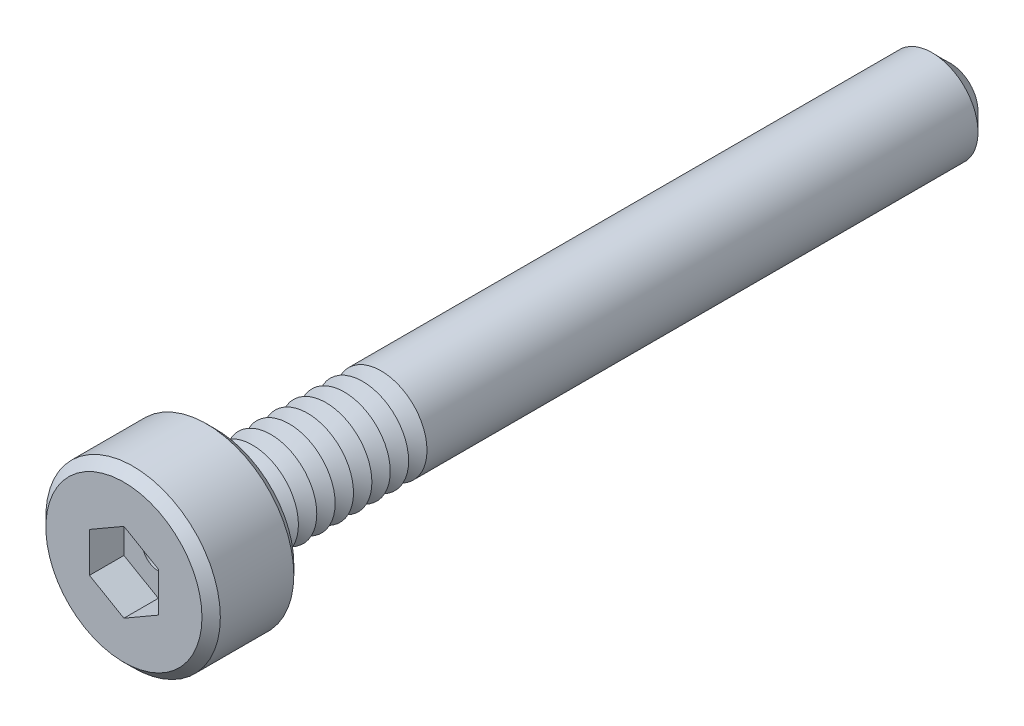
ISO-10303-21;
HEADER;
FILE_DESCRIPTION(('STEP AP214'),'2;1');
FILE_NAME('part.step','',(''),(''),'','','');
FILE_SCHEMA(('AUTOMOTIVE_DESIGN { 1 0 10303 214 1 1 1 1 }'));
ENDSEC;
DATA;
#1=APPLICATION_CONTEXT('core data for automotive mechanical design processes');
#2=APPLICATION_PROTOCOL_DEFINITION('international standard','automotive_design',2000,#1);
#3=PRODUCT_CONTEXT('',#1,'mechanical');
#4=PRODUCT('Part','Part','',(#3));
#5=PRODUCT_RELATED_PRODUCT_CATEGORY('part','',(#4));
#6=PRODUCT_DEFINITION_FORMATION('','',#4);
#7=PRODUCT_DEFINITION_CONTEXT('part definition',#1,'design');
#8=PRODUCT_DEFINITION('design','',#6,#7);
#9=PRODUCT_DEFINITION_SHAPE('','',#8);
#10=(LENGTH_UNIT() NAMED_UNIT(*) SI_UNIT(.MILLI.,.METRE.));
#11=(NAMED_UNIT(*) PLANE_ANGLE_UNIT() SI_UNIT($,.RADIAN.));
#12=(NAMED_UNIT(*) SI_UNIT($,.STERADIAN.) SOLID_ANGLE_UNIT());
#13=UNCERTAINTY_MEASURE_WITH_UNIT(LENGTH_MEASURE(1.E-05),#10,'distance_accuracy_value','');
#14=(GEOMETRIC_REPRESENTATION_CONTEXT(3) GLOBAL_UNCERTAINTY_ASSIGNED_CONTEXT((#13)) GLOBAL_UNIT_ASSIGNED_CONTEXT((#10,
#11,#12)) REPRESENTATION_CONTEXT('',''));
#15=CARTESIAN_POINT('',(0.,0.,0.));
#16=DIRECTION('',(0.,0.,1.));
#17=DIRECTION('',(1.,0.,0.));
#18=AXIS2_PLACEMENT_3D('',#15,#16,#17);
#19=CARTESIAN_POINT('',(0.,0.,2.));
#20=DIRECTION('',(0.,0.,-1.));
#21=DIRECTION('',(-1.,0.,0.));
#22=AXIS2_PLACEMENT_3D('',#19,#20,#21);
#23=CYLINDRICAL_SURFACE('',#22,1.9);
#24=CARTESIAN_POINT('',(0.,0.,0.199999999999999));
#25=DIRECTION('',(0.,0.,1.));
#26=DIRECTION('',(1.,0.,0.));
#27=AXIS2_PLACEMENT_3D('',#24,#25,#26);
#28=CIRCLE('',#27,1.9);
#29=CARTESIAN_POINT('',(1.9,0.,0.199999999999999));
#30=VERTEX_POINT('',#29);
#31=EDGE_CURVE('E252',#30,#30,#28,.T.);
#32=ORIENTED_EDGE('',*,*,#31,.T.);
#33=EDGE_LOOP('',(#32));
#34=FACE_BOUND('',#33,.T.);
#35=CARTESIAN_POINT('',(0.,0.,1.8));
#36=DIRECTION('',(0.,0.,1.));
#37=DIRECTION('',(1.,0.,0.));
#38=AXIS2_PLACEMENT_3D('',#35,#36,#37);
#39=CIRCLE('',#38,1.9);
#40=CARTESIAN_POINT('',(1.9,0.,1.8));
#41=VERTEX_POINT('',#40);
#42=EDGE_CURVE('E248',#41,#41,#39,.F.);
#43=ORIENTED_EDGE('',*,*,#42,.T.);
#44=EDGE_LOOP('',(#43));
#45=FACE_BOUND('',#44,.T.);
#46=ADVANCED_FACE('F39',(#34,#45),#23,.T.);
#47=CARTESIAN_POINT('',(0.,0.,2.));
#48=DIRECTION('',(0.,0.,1.));
#49=DIRECTION('',(1.,0.,0.));
#50=AXIS2_PLACEMENT_3D('',#47,#48,#49);
#51=PLANE('',#50);
#52=CARTESIAN_POINT('',(0.,0.,2.));
#53=DIRECTION('',(0.,0.,1.));
#54=DIRECTION('',(1.,0.,0.));
#55=AXIS2_PLACEMENT_3D('',#52,#53,#54);
#56=CIRCLE('',#55,1.7);
#57=CARTESIAN_POINT('',(1.7,0.,2.));
#58=VERTEX_POINT('',#57);
#59=EDGE_CURVE('E11',#58,#58,#56,.T.);
#60=ORIENTED_EDGE('',*,*,#59,.T.);
#61=EDGE_LOOP('',(#60));
#62=FACE_BOUND('',#61,.T.);
#63=DIRECTION('',(-0.866025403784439,0.5,0.));
#64=VECTOR('',#63,1.);
#65=CARTESIAN_POINT('',(0.749999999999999,0.433012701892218,2.));
#66=LINE('',#65,#64);
#67=CARTESIAN_POINT('',(0.749999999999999,0.433012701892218,2.));
#68=VERTEX_POINT('',#67);
#69=CARTESIAN_POINT('',(0.,0.866025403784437,2.));
#70=VERTEX_POINT('',#69);
#71=EDGE_CURVE('E55',#68,#70,#66,.T.);
#72=ORIENTED_EDGE('',*,*,#71,.F.);
#73=DIRECTION('',(0.,1.,0.));
#74=VECTOR('',#73,1.);
#75=CARTESIAN_POINT('',(0.75,-0.433012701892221,2.));
#76=LINE('',#75,#74);
#77=CARTESIAN_POINT('',(0.75,-0.433012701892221,2.));
#78=VERTEX_POINT('',#77);
#79=EDGE_CURVE('E150',#78,#68,#76,.T.);
#80=ORIENTED_EDGE('',*,*,#79,.F.);
#81=DIRECTION('',(0.866025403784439,0.5,0.));
#82=VECTOR('',#81,1.);
#83=CARTESIAN_POINT('',(0.,-0.86602540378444,2.));
#84=LINE('',#83,#82);
#85=CARTESIAN_POINT('',(0.,-0.86602540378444,2.));
#86=VERTEX_POINT('',#85);
#87=EDGE_CURVE('E147',#86,#78,#84,.T.);
#88=ORIENTED_EDGE('',*,*,#87,.F.);
#89=DIRECTION('',(0.866025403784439,-0.5,0.));
#90=VECTOR('',#89,1.);
#91=CARTESIAN_POINT('',(-0.75,-0.433012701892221,2.));
#92=LINE('',#91,#90);
#93=CARTESIAN_POINT('',(-0.75,-0.433012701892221,2.));
#94=VERTEX_POINT('',#93);
#95=EDGE_CURVE('E103',#94,#86,#92,.T.);
#96=ORIENTED_EDGE('',*,*,#95,.F.);
#97=DIRECTION('',(0.,-1.,0.));
#98=VECTOR('',#97,1.);
#99=CARTESIAN_POINT('',(-0.75,0.433012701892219,2.));
#100=LINE('',#99,#98);
#101=CARTESIAN_POINT('',(-0.75,0.433012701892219,2.));
#102=VERTEX_POINT('',#101);
#103=EDGE_CURVE('E141',#102,#94,#100,.T.);
#104=ORIENTED_EDGE('',*,*,#103,.F.);
#105=DIRECTION('',(-0.866025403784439,-0.499999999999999,0.));
#106=VECTOR('',#105,1.);
#107=CARTESIAN_POINT('',(0.,0.866025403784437,2.));
#108=LINE('',#107,#106);
#109=EDGE_CURVE('E136',#70,#102,#108,.T.);
#110=ORIENTED_EDGE('',*,*,#109,.F.);
#111=EDGE_LOOP('',(#72,#80,#88,#96,#104,#110));
#112=FACE_BOUND('',#111,.T.);
#113=ADVANCED_FACE('F270',(#62,#112),#51,.T.);
#114=CARTESIAN_POINT('',(0.,0.,0.));
#115=DIRECTION('',(0.,0.,1.));
#116=DIRECTION('',(1.,0.,0.));
#117=AXIS2_PLACEMENT_3D('',#114,#115,#116);
#118=PLANE('',#117);
#119=CARTESIAN_POINT('',(0.,0.,0.));
#120=DIRECTION('',(0.,0.,1.));
#121=DIRECTION('',(1.,0.,0.));
#122=AXIS2_PLACEMENT_3D('',#119,#120,#121);
#123=CIRCLE('',#122,1.7);
#124=CARTESIAN_POINT('',(1.7,0.,0.));
#125=VERTEX_POINT('',#124);
#126=EDGE_CURVE('E48',#125,#125,#123,.F.);
#127=ORIENTED_EDGE('',*,*,#126,.T.);
#128=EDGE_LOOP('',(#127));
#129=FACE_BOUND('',#128,.T.);
#130=CARTESIAN_POINT('',(0.,0.,0.));
#131=DIRECTION('',(0.,0.,1.));
#132=DIRECTION('',(1.,0.,0.));
#133=AXIS2_PLACEMENT_3D('',#130,#131,#132);
#134=CIRCLE('',#133,1.);
#135=CARTESIAN_POINT('',(1.,0.,0.));
#136=VERTEX_POINT('',#135);
#137=EDGE_CURVE('E236',#136,#136,#134,.T.);
#138=ORIENTED_EDGE('',*,*,#137,.T.);
#139=EDGE_LOOP('',(#138));
#140=FACE_BOUND('',#139,.T.);
#141=ADVANCED_FACE('F259',(#129,#140),#118,.F.);
#142=CARTESIAN_POINT('',(0.,0.,0.));
#143=DIRECTION('',(0.,0.,1.));
#144=DIRECTION('',(1.,0.,0.));
#145=AXIS2_PLACEMENT_3D('',#142,#143,#144);
#146=CONICAL_SURFACE('',#145,1.,1.0471975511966);
#147=CARTESIAN_POINT('',(0.,0.,-0.200000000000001));
#148=DIRECTION('',(0.,0.,1.));
#149=DIRECTION('',(1.,0.,0.));
#150=AXIS2_PLACEMENT_3D('',#147,#148,#149);
#151=CIRCLE('',#150,0.653589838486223);
#152=CARTESIAN_POINT('',(0.653589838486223,0.,-0.200000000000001));
#153=VERTEX_POINT('',#152);
#154=EDGE_CURVE('E232',#153,#153,#151,.T.);
#155=ORIENTED_EDGE('',*,*,#154,.T.);
#156=EDGE_LOOP('',(#155));
#157=FACE_BOUND('',#156,.T.);
#158=ORIENTED_EDGE('',*,*,#137,.F.);
#159=EDGE_LOOP('',(#158));
#160=FACE_BOUND('',#159,.T.);
#161=ADVANCED_FACE('F392',(#157,#160),#146,.T.);
#162=CARTESIAN_POINT('',(0.,0.,-0.200000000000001));
#163=DIRECTION('',(0.,0.,-1.));
#164=DIRECTION('',(-1.,0.,0.));
#165=AXIS2_PLACEMENT_3D('',#162,#163,#164);
#166=CONICAL_SURFACE('',#165,0.653589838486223,1.0471975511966);
#167=CARTESIAN_POINT('',(0.,0.,-0.4));
#168=DIRECTION('',(0.,0.,1.));
#169=DIRECTION('',(1.,0.,0.));
#170=AXIS2_PLACEMENT_3D('',#167,#168,#169);
#171=CIRCLE('',#170,1.);
#172=CARTESIAN_POINT('',(1.,0.,-0.4));
#173=VERTEX_POINT('',#172);
#174=EDGE_CURVE('E228',#173,#173,#171,.T.);
#175=ORIENTED_EDGE('',*,*,#174,.T.);
#176=EDGE_LOOP('',(#175));
#177=FACE_BOUND('',#176,.T.);
#178=ORIENTED_EDGE('',*,*,#154,.F.);
#179=EDGE_LOOP('',(#178));
#180=FACE_BOUND('',#179,.T.);
#181=ADVANCED_FACE('F388',(#177,#180),#166,.T.);
#182=CARTESIAN_POINT('',(0.,0.,-0.4));
#183=DIRECTION('',(0.,0.,1.));
#184=DIRECTION('',(1.,0.,0.));
#185=AXIS2_PLACEMENT_3D('',#182,#183,#184);
#186=CONICAL_SURFACE('',#185,1.,1.0471975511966);
#187=CARTESIAN_POINT('',(0.,0.,-0.600000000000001));
#188=DIRECTION('',(0.,0.,1.));
#189=DIRECTION('',(1.,0.,0.));
#190=AXIS2_PLACEMENT_3D('',#187,#188,#189);
#191=CIRCLE('',#190,0.653589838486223);
#192=CARTESIAN_POINT('',(0.653589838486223,0.,-0.600000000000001));
#193=VERTEX_POINT('',#192);
#194=EDGE_CURVE('E224',#193,#193,#191,.T.);
#195=ORIENTED_EDGE('',*,*,#194,.T.);
#196=EDGE_LOOP('',(#195));
#197=FACE_BOUND('',#196,.T.);
#198=ORIENTED_EDGE('',*,*,#174,.F.);
#199=EDGE_LOOP('',(#198));
#200=FACE_BOUND('',#199,.T.);
#201=ADVANCED_FACE('F384',(#197,#200),#186,.T.);
#202=CARTESIAN_POINT('',(0.,0.,-0.600000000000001));
#203=DIRECTION('',(0.,0.,-1.));
#204=DIRECTION('',(-1.,0.,0.));
#205=AXIS2_PLACEMENT_3D('',#202,#203,#204);
#206=CONICAL_SURFACE('',#205,0.653589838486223,1.0471975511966);
#207=CARTESIAN_POINT('',(0.,0.,-0.8));
#208=DIRECTION('',(0.,0.,1.));
#209=DIRECTION('',(1.,0.,0.));
#210=AXIS2_PLACEMENT_3D('',#207,#208,#209);
#211=CIRCLE('',#210,1.);
#212=CARTESIAN_POINT('',(1.,0.,-0.8));
#213=VERTEX_POINT('',#212);
#214=EDGE_CURVE('E220',#213,#213,#211,.T.);
#215=ORIENTED_EDGE('',*,*,#214,.T.);
#216=EDGE_LOOP('',(#215));
#217=FACE_BOUND('',#216,.T.);
#218=ORIENTED_EDGE('',*,*,#194,.F.);
#219=EDGE_LOOP('',(#218));
#220=FACE_BOUND('',#219,.T.);
#221=ADVANCED_FACE('F380',(#217,#220),#206,.T.);
#222=CARTESIAN_POINT('',(0.,0.,-0.8));
#223=DIRECTION('',(0.,0.,1.));
#224=DIRECTION('',(1.,0.,0.));
#225=AXIS2_PLACEMENT_3D('',#222,#223,#224);
#226=CONICAL_SURFACE('',#225,1.,1.0471975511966);
#227=CARTESIAN_POINT('',(0.,0.,-1.));
#228=DIRECTION('',(0.,0.,1.));
#229=DIRECTION('',(1.,0.,0.));
#230=AXIS2_PLACEMENT_3D('',#227,#228,#229);
#231=CIRCLE('',#230,0.653589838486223);
#232=CARTESIAN_POINT('',(0.653589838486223,0.,-1.));
#233=VERTEX_POINT('',#232);
#234=EDGE_CURVE('E216',#233,#233,#231,.T.);
#235=ORIENTED_EDGE('',*,*,#234,.T.);
#236=EDGE_LOOP('',(#235));
#237=FACE_BOUND('',#236,.T.);
#238=ORIENTED_EDGE('',*,*,#214,.F.);
#239=EDGE_LOOP('',(#238));
#240=FACE_BOUND('',#239,.T.);
#241=ADVANCED_FACE('F376',(#237,#240),#226,.T.);
#242=CARTESIAN_POINT('',(0.,0.,-1.));
#243=DIRECTION('',(0.,0.,-1.));
#244=DIRECTION('',(-1.,0.,0.));
#245=AXIS2_PLACEMENT_3D('',#242,#243,#244);
#246=CONICAL_SURFACE('',#245,0.653589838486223,1.0471975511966);
#247=CARTESIAN_POINT('',(0.,0.,-1.2));
#248=DIRECTION('',(0.,0.,1.));
#249=DIRECTION('',(1.,0.,0.));
#250=AXIS2_PLACEMENT_3D('',#247,#248,#249);
#251=CIRCLE('',#250,1.);
#252=CARTESIAN_POINT('',(1.,0.,-1.2));
#253=VERTEX_POINT('',#252);
#254=EDGE_CURVE('E212',#253,#253,#251,.T.);
#255=ORIENTED_EDGE('',*,*,#254,.T.);
#256=EDGE_LOOP('',(#255));
#257=FACE_BOUND('',#256,.T.);
#258=ORIENTED_EDGE('',*,*,#234,.F.);
#259=EDGE_LOOP('',(#258));
#260=FACE_BOUND('',#259,.T.);
#261=ADVANCED_FACE('F372',(#257,#260),#246,.T.);
#262=CARTESIAN_POINT('',(0.,0.,-1.2));
#263=DIRECTION('',(0.,0.,1.));
#264=DIRECTION('',(1.,0.,0.));
#265=AXIS2_PLACEMENT_3D('',#262,#263,#264);
#266=CONICAL_SURFACE('',#265,1.,1.0471975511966);
#267=CARTESIAN_POINT('',(0.,0.,-1.4));
#268=DIRECTION('',(0.,0.,1.));
#269=DIRECTION('',(1.,0.,0.));
#270=AXIS2_PLACEMENT_3D('',#267,#268,#269);
#271=CIRCLE('',#270,0.653589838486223);
#272=CARTESIAN_POINT('',(0.653589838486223,0.,-1.4));
#273=VERTEX_POINT('',#272);
#274=EDGE_CURVE('E208',#273,#273,#271,.T.);
#275=ORIENTED_EDGE('',*,*,#274,.T.);
#276=EDGE_LOOP('',(#275));
#277=FACE_BOUND('',#276,.T.);
#278=ORIENTED_EDGE('',*,*,#254,.F.);
#279=EDGE_LOOP('',(#278));
#280=FACE_BOUND('',#279,.T.);
#281=ADVANCED_FACE('F368',(#277,#280),#266,.T.);
#282=CARTESIAN_POINT('',(0.,0.,-1.4));
#283=DIRECTION('',(0.,0.,-1.));
#284=DIRECTION('',(-1.,0.,0.));
#285=AXIS2_PLACEMENT_3D('',#282,#283,#284);
#286=CONICAL_SURFACE('',#285,0.653589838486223,1.0471975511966);
#287=CARTESIAN_POINT('',(0.,0.,-1.6));
#288=DIRECTION('',(0.,0.,1.));
#289=DIRECTION('',(1.,0.,0.));
#290=AXIS2_PLACEMENT_3D('',#287,#288,#289);
#291=CIRCLE('',#290,1.);
#292=CARTESIAN_POINT('',(1.,0.,-1.6));
#293=VERTEX_POINT('',#292);
#294=EDGE_CURVE('E204',#293,#293,#291,.T.);
#295=ORIENTED_EDGE('',*,*,#294,.T.);
#296=EDGE_LOOP('',(#295));
#297=FACE_BOUND('',#296,.T.);
#298=ORIENTED_EDGE('',*,*,#274,.F.);
#299=EDGE_LOOP('',(#298));
#300=FACE_BOUND('',#299,.T.);
#301=ADVANCED_FACE('F364',(#297,#300),#286,.T.);
#302=CARTESIAN_POINT('',(0.,0.,-1.6));
#303=DIRECTION('',(0.,0.,1.));
#304=DIRECTION('',(1.,0.,0.));
#305=AXIS2_PLACEMENT_3D('',#302,#303,#304);
#306=CONICAL_SURFACE('',#305,1.,1.0471975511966);
#307=CARTESIAN_POINT('',(0.,0.,-1.8));
#308=DIRECTION('',(0.,0.,1.));
#309=DIRECTION('',(1.,0.,0.));
#310=AXIS2_PLACEMENT_3D('',#307,#308,#309);
#311=CIRCLE('',#310,0.653589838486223);
#312=CARTESIAN_POINT('',(0.653589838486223,0.,-1.8));
#313=VERTEX_POINT('',#312);
#314=EDGE_CURVE('E200',#313,#313,#311,.T.);
#315=ORIENTED_EDGE('',*,*,#314,.T.);
#316=EDGE_LOOP('',(#315));
#317=FACE_BOUND('',#316,.T.);
#318=ORIENTED_EDGE('',*,*,#294,.F.);
#319=EDGE_LOOP('',(#318));
#320=FACE_BOUND('',#319,.T.);
#321=ADVANCED_FACE('F360',(#317,#320),#306,.T.);
#322=CARTESIAN_POINT('',(0.,0.,-1.8));
#323=DIRECTION('',(0.,0.,-1.));
#324=DIRECTION('',(-1.,0.,0.));
#325=AXIS2_PLACEMENT_3D('',#322,#323,#324);
#326=CONICAL_SURFACE('',#325,0.653589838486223,1.0471975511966);
#327=CARTESIAN_POINT('',(0.,0.,-2.));
#328=DIRECTION('',(0.,0.,1.));
#329=DIRECTION('',(1.,0.,0.));
#330=AXIS2_PLACEMENT_3D('',#327,#328,#329);
#331=CIRCLE('',#330,1.);
#332=CARTESIAN_POINT('',(1.,0.,-2.));
#333=VERTEX_POINT('',#332);
#334=EDGE_CURVE('E196',#333,#333,#331,.T.);
#335=ORIENTED_EDGE('',*,*,#334,.T.);
#336=EDGE_LOOP('',(#335));
#337=FACE_BOUND('',#336,.T.);
#338=ORIENTED_EDGE('',*,*,#314,.F.);
#339=EDGE_LOOP('',(#338));
#340=FACE_BOUND('',#339,.T.);
#341=ADVANCED_FACE('F356',(#337,#340),#326,.T.);
#342=CARTESIAN_POINT('',(0.,0.,-2.));
#343=DIRECTION('',(0.,0.,1.));
#344=DIRECTION('',(1.,0.,0.));
#345=AXIS2_PLACEMENT_3D('',#342,#343,#344);
#346=CONICAL_SURFACE('',#345,1.,1.0471975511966);
#347=CARTESIAN_POINT('',(0.,0.,-2.2));
#348=DIRECTION('',(0.,0.,1.));
#349=DIRECTION('',(1.,0.,0.));
#350=AXIS2_PLACEMENT_3D('',#347,#348,#349);
#351=CIRCLE('',#350,0.653589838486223);
#352=CARTESIAN_POINT('',(0.653589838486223,0.,-2.2));
#353=VERTEX_POINT('',#352);
#354=EDGE_CURVE('E192',#353,#353,#351,.T.);
#355=ORIENTED_EDGE('',*,*,#354,.T.);
#356=EDGE_LOOP('',(#355));
#357=FACE_BOUND('',#356,.T.);
#358=ORIENTED_EDGE('',*,*,#334,.F.);
#359=EDGE_LOOP('',(#358));
#360=FACE_BOUND('',#359,.T.);
#361=ADVANCED_FACE('F352',(#357,#360),#346,.T.);
#362=CARTESIAN_POINT('',(0.,0.,-2.2));
#363=DIRECTION('',(0.,0.,-1.));
#364=DIRECTION('',(-1.,0.,0.));
#365=AXIS2_PLACEMENT_3D('',#362,#363,#364);
#366=CONICAL_SURFACE('',#365,0.653589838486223,1.0471975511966);
#367=CARTESIAN_POINT('',(0.,0.,-2.4));
#368=DIRECTION('',(0.,0.,1.));
#369=DIRECTION('',(1.,0.,0.));
#370=AXIS2_PLACEMENT_3D('',#367,#368,#369);
#371=CIRCLE('',#370,1.);
#372=CARTESIAN_POINT('',(1.,0.,-2.4));
#373=VERTEX_POINT('',#372);
#374=EDGE_CURVE('E188',#373,#373,#371,.T.);
#375=ORIENTED_EDGE('',*,*,#374,.T.);
#376=EDGE_LOOP('',(#375));
#377=FACE_BOUND('',#376,.T.);
#378=ORIENTED_EDGE('',*,*,#354,.F.);
#379=EDGE_LOOP('',(#378));
#380=FACE_BOUND('',#379,.T.);
#381=ADVANCED_FACE('F348',(#377,#380),#366,.T.);
#382=CARTESIAN_POINT('',(0.,0.,-2.4));
#383=DIRECTION('',(0.,0.,1.));
#384=DIRECTION('',(1.,0.,0.));
#385=AXIS2_PLACEMENT_3D('',#382,#383,#384);
#386=CONICAL_SURFACE('',#385,1.,1.0471975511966);
#387=CARTESIAN_POINT('',(0.,0.,-2.6));
#388=DIRECTION('',(0.,0.,1.));
#389=DIRECTION('',(1.,0.,0.));
#390=AXIS2_PLACEMENT_3D('',#387,#388,#389);
#391=CIRCLE('',#390,0.653589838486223);
#392=CARTESIAN_POINT('',(0.653589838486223,0.,-2.6));
#393=VERTEX_POINT('',#392);
#394=EDGE_CURVE('E184',#393,#393,#391,.T.);
#395=ORIENTED_EDGE('',*,*,#394,.T.);
#396=EDGE_LOOP('',(#395));
#397=FACE_BOUND('',#396,.T.);
#398=ORIENTED_EDGE('',*,*,#374,.F.);
#399=EDGE_LOOP('',(#398));
#400=FACE_BOUND('',#399,.T.);
#401=ADVANCED_FACE('F344',(#397,#400),#386,.T.);
#402=CARTESIAN_POINT('',(0.,0.,-2.6));
#403=DIRECTION('',(0.,0.,-1.));
#404=DIRECTION('',(-1.,0.,0.));
#405=AXIS2_PLACEMENT_3D('',#402,#403,#404);
#406=CONICAL_SURFACE('',#405,0.653589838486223,1.0471975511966);
#407=CARTESIAN_POINT('',(0.,0.,-2.8));
#408=DIRECTION('',(0.,0.,1.));
#409=DIRECTION('',(1.,0.,0.));
#410=AXIS2_PLACEMENT_3D('',#407,#408,#409);
#411=CIRCLE('',#410,1.);
#412=CARTESIAN_POINT('',(1.,0.,-2.8));
#413=VERTEX_POINT('',#412);
#414=EDGE_CURVE('E181',#413,#413,#411,.T.);
#415=ORIENTED_EDGE('',*,*,#414,.T.);
#416=EDGE_LOOP('',(#415));
#417=FACE_BOUND('',#416,.T.);
#418=ORIENTED_EDGE('',*,*,#394,.F.);
#419=EDGE_LOOP('',(#418));
#420=FACE_BOUND('',#419,.T.);
#421=ADVANCED_FACE('F340',(#417,#420),#406,.T.);
#422=CARTESIAN_POINT('',(0.,0.,-2.8));
#423=DIRECTION('',(0.,0.,1.));
#424=DIRECTION('',(1.,0.,0.));
#425=AXIS2_PLACEMENT_3D('',#422,#423,#424);
#426=CONICAL_SURFACE('',#425,1.,1.0471975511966);
#427=CARTESIAN_POINT('',(0.,0.,-3.));
#428=DIRECTION('',(0.,0.,1.));
#429=DIRECTION('',(1.,0.,0.));
#430=AXIS2_PLACEMENT_3D('',#427,#428,#429);
#431=CIRCLE('',#430,0.653589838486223);
#432=CARTESIAN_POINT('',(0.653589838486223,0.,-3.));
#433=VERTEX_POINT('',#432);
#434=EDGE_CURVE('E177',#433,#433,#431,.T.);
#435=ORIENTED_EDGE('',*,*,#434,.T.);
#436=EDGE_LOOP('',(#435));
#437=FACE_BOUND('',#436,.T.);
#438=ORIENTED_EDGE('',*,*,#414,.F.);
#439=EDGE_LOOP('',(#438));
#440=FACE_BOUND('',#439,.T.);
#441=ADVANCED_FACE('F336',(#437,#440),#426,.T.);
#442=CARTESIAN_POINT('',(0.,0.,-3.));
#443=DIRECTION('',(0.,0.,-1.));
#444=DIRECTION('',(-1.,0.,0.));
#445=AXIS2_PLACEMENT_3D('',#442,#443,#444);
#446=CONICAL_SURFACE('',#445,0.653589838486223,1.0471975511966);
#447=CARTESIAN_POINT('',(0.,0.,-3.2));
#448=DIRECTION('',(0.,0.,1.));
#449=DIRECTION('',(1.,0.,0.));
#450=AXIS2_PLACEMENT_3D('',#447,#448,#449);
#451=CIRCLE('',#450,1.);
#452=CARTESIAN_POINT('',(1.,0.,-3.2));
#453=VERTEX_POINT('',#452);
#454=EDGE_CURVE('E173',#453,#453,#451,.T.);
#455=ORIENTED_EDGE('',*,*,#454,.T.);
#456=EDGE_LOOP('',(#455));
#457=FACE_BOUND('',#456,.T.);
#458=ORIENTED_EDGE('',*,*,#434,.F.);
#459=EDGE_LOOP('',(#458));
#460=FACE_BOUND('',#459,.T.);
#461=ADVANCED_FACE('F332',(#457,#460),#446,.T.);
#462=CARTESIAN_POINT('',(0.,0.,-3.2));
#463=DIRECTION('',(0.,0.,1.));
#464=DIRECTION('',(1.,0.,0.));
#465=AXIS2_PLACEMENT_3D('',#462,#463,#464);
#466=CONICAL_SURFACE('',#465,1.,1.0471975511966);
#467=CARTESIAN_POINT('',(0.,0.,-3.4));
#468=DIRECTION('',(0.,0.,1.));
#469=DIRECTION('',(1.,0.,0.));
#470=AXIS2_PLACEMENT_3D('',#467,#468,#469);
#471=CIRCLE('',#470,0.653589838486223);
#472=CARTESIAN_POINT('',(0.653589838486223,0.,-3.4));
#473=VERTEX_POINT('',#472);
#474=EDGE_CURVE('E169',#473,#473,#471,.T.);
#475=ORIENTED_EDGE('',*,*,#474,.T.);
#476=EDGE_LOOP('',(#475));
#477=FACE_BOUND('',#476,.T.);
#478=ORIENTED_EDGE('',*,*,#454,.F.);
#479=EDGE_LOOP('',(#478));
#480=FACE_BOUND('',#479,.T.);
#481=ADVANCED_FACE('F328',(#477,#480),#466,.T.);
#482=CARTESIAN_POINT('',(0.,0.,-3.4));
#483=DIRECTION('',(0.,0.,-1.));
#484=DIRECTION('',(-1.,0.,0.));
#485=AXIS2_PLACEMENT_3D('',#482,#483,#484);
#486=CONICAL_SURFACE('',#485,0.653589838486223,1.0471975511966);
#487=CARTESIAN_POINT('',(0.,0.,-3.6));
#488=DIRECTION('',(0.,0.,1.));
#489=DIRECTION('',(1.,0.,0.));
#490=AXIS2_PLACEMENT_3D('',#487,#488,#489);
#491=CIRCLE('',#490,1.);
#492=CARTESIAN_POINT('',(1.,0.,-3.6));
#493=VERTEX_POINT('',#492);
#494=EDGE_CURVE('E156',#493,#493,#491,.T.);
#495=ORIENTED_EDGE('',*,*,#494,.T.);
#496=EDGE_LOOP('',(#495));
#497=FACE_BOUND('',#496,.T.);
#498=ORIENTED_EDGE('',*,*,#474,.F.);
#499=EDGE_LOOP('',(#498));
#500=FACE_BOUND('',#499,.T.);
#501=ADVANCED_FACE('F324',(#497,#500),#486,.T.);
#502=CARTESIAN_POINT('',(0.,0.,-16.));
#503=DIRECTION('',(0.,0.,-1.));
#504=DIRECTION('',(-1.,0.,0.));
#505=AXIS2_PLACEMENT_3D('',#502,#503,#504);
#506=PLANE('',#505);
#507=CARTESIAN_POINT('',(0.,0.,-16.));
#508=DIRECTION('',(0.,0.,-1.));
#509=DIRECTION('',(-1.,0.,0.));
#510=AXIS2_PLACEMENT_3D('',#507,#508,#509);
#511=CIRCLE('',#510,0.35);
#512=CARTESIAN_POINT('',(-0.35,0.,-16.));
#513=VERTEX_POINT('',#512);
#514=EDGE_CURVE('E137',#513,#513,#511,.F.);
#515=ORIENTED_EDGE('',*,*,#514,.T.);
#516=EDGE_LOOP('',(#515));
#517=FACE_BOUND('',#516,.T.);
#518=CARTESIAN_POINT('',(0.,0.,-16.));
#519=DIRECTION('',(0.,0.,-1.));
#520=DIRECTION('',(-1.,0.,0.));
#521=AXIS2_PLACEMENT_3D('',#518,#519,#520);
#522=CIRCLE('',#521,0.600000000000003);
#523=CARTESIAN_POINT('',(-0.600000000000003,0.,-16.));
#524=VERTEX_POINT('',#523);
#525=EDGE_CURVE('E240',#524,#524,#522,.T.);
#526=ORIENTED_EDGE('',*,*,#525,.T.);
#527=EDGE_LOOP('',(#526));
#528=FACE_BOUND('',#527,.T.);
#529=ADVANCED_FACE('F327',(#517,#528),#506,.T.);
#530=CARTESIAN_POINT('',(0.,0.,-16.));
#531=DIRECTION('',(0.,0.,1.));
#532=DIRECTION('',(1.,0.,0.));
#533=AXIS2_PLACEMENT_3D('',#530,#531,#532);
#534=CONICAL_SURFACE('',#533,0.600000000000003,0.785398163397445);
#535=CARTESIAN_POINT('',(0.,0.,-15.6));
#536=DIRECTION('',(0.,0.,-1.));
#537=DIRECTION('',(-1.,0.,0.));
#538=AXIS2_PLACEMENT_3D('',#535,#536,#537);
#539=CIRCLE('',#538,1.);
#540=CARTESIAN_POINT('',(-1.,0.,-15.6));
#541=VERTEX_POINT('',#540);
#542=EDGE_CURVE('E244',#541,#541,#539,.F.);
#543=ORIENTED_EDGE('',*,*,#542,.F.);
#544=EDGE_LOOP('',(#543));
#545=FACE_BOUND('',#544,.T.);
#546=ORIENTED_EDGE('',*,*,#525,.F.);
#547=EDGE_LOOP('',(#546));
#548=FACE_BOUND('',#547,.T.);
#549=ADVANCED_FACE('F399',(#545,#548),#534,.T.);
#550=CARTESIAN_POINT('',(0.,0.,-16.));
#551=DIRECTION('',(0.,0.,1.));
#552=DIRECTION('',(1.,0.,0.));
#553=AXIS2_PLACEMENT_3D('',#550,#551,#552);
#554=CYLINDRICAL_SURFACE('',#553,1.);
#555=ORIENTED_EDGE('',*,*,#542,.T.);
#556=EDGE_LOOP('',(#555));
#557=FACE_BOUND('',#556,.T.);
#558=ORIENTED_EDGE('',*,*,#494,.F.);
#559=EDGE_LOOP('',(#558));
#560=FACE_BOUND('',#559,.T.);
#561=ADVANCED_FACE('F323',(#557,#560),#554,.T.);
#562=CARTESIAN_POINT('',(0.749999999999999,0.433012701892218,1.25));
#563=DIRECTION('',(0.5,0.866025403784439,0.));
#564=DIRECTION('',(-0.866025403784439,0.5,0.));
#565=AXIS2_PLACEMENT_3D('',#562,#563,#564);
#566=PLANE('',#565);
#567=ORIENTED_EDGE('',*,*,#71,.T.);
#568=DIRECTION('',(0.,0.,1.));
#569=VECTOR('',#568,1.);
#570=CARTESIAN_POINT('',(0.,0.866025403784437,1.25));
#571=LINE('',#570,#569);
#572=CARTESIAN_POINT('',(0.,0.866025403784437,1.25));
#573=VERTEX_POINT('',#572);
#574=EDGE_CURVE('E85',#573,#70,#571,.T.);
#575=ORIENTED_EDGE('',*,*,#574,.F.);
#576=DIRECTION('',(-0.866025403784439,0.5,0.));
#577=VECTOR('',#576,1.);
#578=CARTESIAN_POINT('',(0.749999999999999,0.433012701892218,1.25));
#579=LINE('',#578,#577);
#580=CARTESIAN_POINT('',(0.749999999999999,0.433012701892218,1.25));
#581=VERTEX_POINT('',#580);
#582=EDGE_CURVE('E153',#581,#573,#579,.T.);
#583=ORIENTED_EDGE('',*,*,#582,.F.);
#584=DIRECTION('',(0.,0.,1.));
#585=VECTOR('',#584,1.);
#586=CARTESIAN_POINT('',(0.749999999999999,0.433012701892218,1.25));
#587=LINE('',#586,#585);
#588=EDGE_CURVE('E63',#581,#68,#587,.T.);
#589=ORIENTED_EDGE('',*,*,#588,.T.);
#590=EDGE_LOOP('',(#567,#575,#583,#589));
#591=FACE_BOUND('',#590,.T.);
#592=ADVANCED_FACE('F313',(#591),#566,.F.);
#593=CARTESIAN_POINT('',(0.75,-0.433012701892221,1.25));
#594=DIRECTION('',(1.,0.,0.));
#595=DIRECTION('',(0.,1.,0.));
#596=AXIS2_PLACEMENT_3D('',#593,#594,#595);
#597=PLANE('',#596);
#598=ORIENTED_EDGE('',*,*,#79,.T.);
#599=ORIENTED_EDGE('',*,*,#588,.F.);
#600=DIRECTION('',(0.,1.,0.));
#601=VECTOR('',#600,1.);
#602=CARTESIAN_POINT('',(0.75,-0.433012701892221,1.25));
#603=LINE('',#602,#601);
#604=CARTESIAN_POINT('',(0.75,-0.433012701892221,1.25));
#605=VERTEX_POINT('',#604);
#606=EDGE_CURVE('E117',#605,#581,#603,.T.);
#607=ORIENTED_EDGE('',*,*,#606,.F.);
#608=DIRECTION('',(0.,0.,1.));
#609=VECTOR('',#608,1.);
#610=CARTESIAN_POINT('',(0.75,-0.433012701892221,1.25));
#611=LINE('',#610,#609);
#612=EDGE_CURVE('E108',#605,#78,#611,.T.);
#613=ORIENTED_EDGE('',*,*,#612,.T.);
#614=EDGE_LOOP('',(#598,#599,#607,#613));
#615=FACE_BOUND('',#614,.T.);
#616=ADVANCED_FACE('F310',(#615),#597,.F.);
#617=CARTESIAN_POINT('',(0.,-0.86602540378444,1.25));
#618=DIRECTION('',(0.5,-0.866025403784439,0.));
#619=DIRECTION('',(0.866025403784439,0.5,0.));
#620=AXIS2_PLACEMENT_3D('',#617,#618,#619);
#621=PLANE('',#620);
#622=ORIENTED_EDGE('',*,*,#87,.T.);
#623=ORIENTED_EDGE('',*,*,#612,.F.);
#624=DIRECTION('',(0.866025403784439,0.5,0.));
#625=VECTOR('',#624,1.);
#626=CARTESIAN_POINT('',(0.,-0.86602540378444,1.25));
#627=LINE('',#626,#625);
#628=CARTESIAN_POINT('',(0.,-0.86602540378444,1.25));
#629=VERTEX_POINT('',#628);
#630=EDGE_CURVE('E112',#629,#605,#627,.T.);
#631=ORIENTED_EDGE('',*,*,#630,.F.);
#632=DIRECTION('',(0.,0.,1.));
#633=VECTOR('',#632,1.);
#634=CARTESIAN_POINT('',(0.,-0.86602540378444,1.25));
#635=LINE('',#634,#633);
#636=EDGE_CURVE('E96',#629,#86,#635,.T.);
#637=ORIENTED_EDGE('',*,*,#636,.T.);
#638=EDGE_LOOP('',(#622,#623,#631,#637));
#639=FACE_BOUND('',#638,.T.);
#640=ADVANCED_FACE('F113',(#639),#621,.F.);
#641=CARTESIAN_POINT('',(-0.75,-0.433012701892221,1.25));
#642=DIRECTION('',(-0.5,-0.866025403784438,0.));
#643=DIRECTION('',(0.866025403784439,-0.5,0.));
#644=AXIS2_PLACEMENT_3D('',#641,#642,#643);
#645=PLANE('',#644);
#646=ORIENTED_EDGE('',*,*,#95,.T.);
#647=ORIENTED_EDGE('',*,*,#636,.F.);
#648=DIRECTION('',(0.866025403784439,-0.5,0.));
#649=VECTOR('',#648,1.);
#650=CARTESIAN_POINT('',(-0.75,-0.433012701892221,1.25));
#651=LINE('',#650,#649);
#652=CARTESIAN_POINT('',(-0.75,-0.433012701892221,1.25));
#653=VERTEX_POINT('',#652);
#654=EDGE_CURVE('E100',#653,#629,#651,.T.);
#655=ORIENTED_EDGE('',*,*,#654,.F.);
#656=DIRECTION('',(0.,0.,1.));
#657=VECTOR('',#656,1.);
#658=CARTESIAN_POINT('',(-0.75,-0.433012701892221,1.25));
#659=LINE('',#658,#657);
#660=EDGE_CURVE('E109',#653,#94,#659,.T.);
#661=ORIENTED_EDGE('',*,*,#660,.T.);
#662=EDGE_LOOP('',(#646,#647,#655,#661));
#663=FACE_BOUND('',#662,.T.);
#664=ADVANCED_FACE('F98',(#663),#645,.F.);
#665=CARTESIAN_POINT('',(-0.75,0.433012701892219,1.25));
#666=DIRECTION('',(-1.,0.,0.));
#667=DIRECTION('',(0.,0.,1.));
#668=AXIS2_PLACEMENT_3D('',#665,#666,#667);
#669=PLANE('',#668);
#670=ORIENTED_EDGE('',*,*,#103,.T.);
#671=ORIENTED_EDGE('',*,*,#660,.F.);
#672=DIRECTION('',(0.,-1.,0.));
#673=VECTOR('',#672,1.);
#674=CARTESIAN_POINT('',(-0.75,0.433012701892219,1.25));
#675=LINE('',#674,#673);
#676=CARTESIAN_POINT('',(-0.75,0.433012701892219,1.25));
#677=VERTEX_POINT('',#676);
#678=EDGE_CURVE('E123',#677,#653,#675,.T.);
#679=ORIENTED_EDGE('',*,*,#678,.F.);
#680=DIRECTION('',(0.,0.,1.));
#681=VECTOR('',#680,1.);
#682=CARTESIAN_POINT('',(-0.75,0.433012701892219,1.25));
#683=LINE('',#682,#681);
#684=EDGE_CURVE('E161',#677,#102,#683,.T.);
#685=ORIENTED_EDGE('',*,*,#684,.T.);
#686=EDGE_LOOP('',(#670,#671,#679,#685));
#687=FACE_BOUND('',#686,.T.);
#688=ADVANCED_FACE('F307',(#687),#669,.F.);
#689=CARTESIAN_POINT('',(0.,0.866025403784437,1.25));
#690=DIRECTION('',(-0.499999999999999,0.866025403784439,0.));
#691=DIRECTION('',(-0.866025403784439,-0.499999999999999,0.));
#692=AXIS2_PLACEMENT_3D('',#689,#690,#691);
#693=PLANE('',#692);
#694=ORIENTED_EDGE('',*,*,#109,.T.);
#695=ORIENTED_EDGE('',*,*,#684,.F.);
#696=DIRECTION('',(-0.866025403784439,-0.499999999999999,0.));
#697=VECTOR('',#696,1.);
#698=CARTESIAN_POINT('',(0.,0.866025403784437,1.25));
#699=LINE('',#698,#697);
#700=EDGE_CURVE('E128',#573,#677,#699,.T.);
#701=ORIENTED_EDGE('',*,*,#700,.F.);
#702=ORIENTED_EDGE('',*,*,#574,.T.);
#703=EDGE_LOOP('',(#694,#695,#701,#702));
#704=FACE_BOUND('',#703,.T.);
#705=ADVANCED_FACE('F285',(#704),#693,.F.);
#706=CARTESIAN_POINT('',(0.,0.,1.25));
#707=DIRECTION('',(0.,0.,1.));
#708=DIRECTION('',(1.,0.,0.));
#709=AXIS2_PLACEMENT_3D('',#706,#707,#708);
#710=PLANE('',#709);
#711=CARTESIAN_POINT('',(0.,0.,1.25));
#712=DIRECTION('',(0.,0.,1.));
#713=DIRECTION('',(1.,0.,0.));
#714=AXIS2_PLACEMENT_3D('',#711,#712,#713);
#715=CIRCLE('',#714,0.35);
#716=CARTESIAN_POINT('',(0.35,0.,1.25));
#717=VERTEX_POINT('',#716);
#718=EDGE_CURVE('E293',#717,#717,#715,.T.);
#719=ORIENTED_EDGE('',*,*,#718,.F.);
#720=EDGE_LOOP('',(#719));
#721=FACE_BOUND('',#720,.T.);
#722=ORIENTED_EDGE('',*,*,#582,.T.);
#723=ORIENTED_EDGE('',*,*,#700,.T.);
#724=ORIENTED_EDGE('',*,*,#678,.T.);
#725=ORIENTED_EDGE('',*,*,#654,.T.);
#726=ORIENTED_EDGE('',*,*,#630,.T.);
#727=ORIENTED_EDGE('',*,*,#606,.T.);
#728=EDGE_LOOP('',(#722,#723,#724,#725,#726,#727));
#729=FACE_BOUND('',#728,.T.);
#730=ADVANCED_FACE('F120',(#721,#729),#710,.T.);
#731=CARTESIAN_POINT('',(0.,0.,-16.9899494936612));
#732=DIRECTION('',(0.,0.,1.));
#733=DIRECTION('',(1.,0.,0.));
#734=AXIS2_PLACEMENT_3D('',#731,#732,#733);
#735=CYLINDRICAL_SURFACE('',#734,0.35);
#736=ORIENTED_EDGE('',*,*,#718,.T.);
#737=EDGE_LOOP('',(#736));
#738=FACE_BOUND('',#737,.T.);
#739=ORIENTED_EDGE('',*,*,#514,.F.);
#740=EDGE_LOOP('',(#739));
#741=FACE_BOUND('',#740,.T.);
#742=ADVANCED_FACE('F265',(#738,#741),#735,.F.);
#743=CARTESIAN_POINT('',(0.,0.,0.199999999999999));
#744=DIRECTION('',(0.,0.,1.));
#745=DIRECTION('',(1.,0.,0.));
#746=AXIS2_PLACEMENT_3D('',#743,#744,#745);
#747=CONICAL_SURFACE('',#746,1.9,0.785398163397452);
#748=CARTESIAN_POINT('',(1.7,0.,0.));
#749=CARTESIAN_POINT('',(1.70208333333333,0.,0.00208333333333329));
#750=CARTESIAN_POINT('',(1.70416666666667,0.,0.00416666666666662));
#751=CARTESIAN_POINT('',(1.70833333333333,0.,0.0083333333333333));
#752=CARTESIAN_POINT('',(1.71041666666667,0.,0.0104166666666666));
#753=CARTESIAN_POINT('',(1.71458333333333,0.,0.0145833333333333));
#754=CARTESIAN_POINT('',(1.71666666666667,0.,0.0166666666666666));
#755=CARTESIAN_POINT('',(1.72083333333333,0.,0.0208333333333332));
#756=CARTESIAN_POINT('',(1.72291666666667,0.,0.0229166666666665));
#757=CARTESIAN_POINT('',(1.72708333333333,0.,0.0270833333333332));
#758=CARTESIAN_POINT('',(1.72916666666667,0.,0.0291666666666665));
#759=CARTESIAN_POINT('',(1.73333333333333,0.,0.0333333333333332));
#760=CARTESIAN_POINT('',(1.73541666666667,0.,0.0354166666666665));
#761=CARTESIAN_POINT('',(1.73958333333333,0.,0.0395833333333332));
#762=CARTESIAN_POINT('',(1.74166666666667,0.,0.0416666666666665));
#763=CARTESIAN_POINT('',(1.74583333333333,0.,0.0458333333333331));
#764=CARTESIAN_POINT('',(1.74791666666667,0.,0.0479166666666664));
#765=CARTESIAN_POINT('',(1.75208333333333,0.,0.0520833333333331));
#766=CARTESIAN_POINT('',(1.75416666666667,0.,0.0541666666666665));
#767=CARTESIAN_POINT('',(1.75833333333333,0.,0.0583333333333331));
#768=CARTESIAN_POINT('',(1.76041666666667,0.,0.0604166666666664));
#769=CARTESIAN_POINT('',(1.76458333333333,0.,0.064583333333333));
#770=CARTESIAN_POINT('',(1.76666666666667,0.,0.0666666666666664));
#771=CARTESIAN_POINT('',(1.77083333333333,0.,0.0708333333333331));
#772=CARTESIAN_POINT('',(1.77291666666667,0.,0.0729166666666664));
#773=CARTESIAN_POINT('',(1.77708333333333,0.,0.077083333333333));
#774=CARTESIAN_POINT('',(1.77916666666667,0.,0.0791666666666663));
#775=CARTESIAN_POINT('',(1.78333333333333,0.,0.083333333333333));
#776=CARTESIAN_POINT('',(1.78541666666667,0.,0.0854166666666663));
#777=CARTESIAN_POINT('',(1.78958333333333,0.,0.089583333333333));
#778=CARTESIAN_POINT('',(1.79166666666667,0.,0.0916666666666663));
#779=CARTESIAN_POINT('',(1.79583333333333,0.,0.0958333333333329));
#780=CARTESIAN_POINT('',(1.79791666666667,0.,0.0979166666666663));
#781=CARTESIAN_POINT('',(1.80208333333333,0.,0.102083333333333));
#782=CARTESIAN_POINT('',(1.80416666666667,0.,0.104166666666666));
#783=CARTESIAN_POINT('',(1.80833333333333,0.,0.108333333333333));
#784=CARTESIAN_POINT('',(1.81041666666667,0.,0.110416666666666));
#785=CARTESIAN_POINT('',(1.81458333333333,0.,0.114583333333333));
#786=CARTESIAN_POINT('',(1.81666666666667,0.,0.116666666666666));
#787=CARTESIAN_POINT('',(1.82083333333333,0.,0.120833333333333));
#788=CARTESIAN_POINT('',(1.82291666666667,0.,0.122916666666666));
#789=CARTESIAN_POINT('',(1.82708333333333,0.,0.127083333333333));
#790=CARTESIAN_POINT('',(1.82916666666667,0.,0.129166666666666));
#791=CARTESIAN_POINT('',(1.83333333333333,0.,0.133333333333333));
#792=CARTESIAN_POINT('',(1.83541666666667,0.,0.135416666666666));
#793=CARTESIAN_POINT('',(1.83958333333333,0.,0.139583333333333));
#794=CARTESIAN_POINT('',(1.84166666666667,0.,0.141666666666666));
#795=CARTESIAN_POINT('',(1.84583333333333,0.,0.145833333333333));
#796=CARTESIAN_POINT('',(1.84791666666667,0.,0.147916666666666));
#797=CARTESIAN_POINT('',(1.85208333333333,0.,0.152083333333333));
#798=CARTESIAN_POINT('',(1.85416666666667,0.,0.154166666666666));
#799=CARTESIAN_POINT('',(1.85833333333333,0.,0.158333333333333));
#800=CARTESIAN_POINT('',(1.86041666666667,0.,0.160416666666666));
#801=CARTESIAN_POINT('',(1.86458333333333,0.,0.164583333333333));
#802=CARTESIAN_POINT('',(1.86666666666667,0.,0.166666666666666));
#803=CARTESIAN_POINT('',(1.87083333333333,0.,0.170833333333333));
#804=CARTESIAN_POINT('',(1.87291666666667,0.,0.172916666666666));
#805=CARTESIAN_POINT('',(1.87708333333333,0.,0.177083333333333));
#806=CARTESIAN_POINT('',(1.87916666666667,0.,0.179166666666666));
#807=CARTESIAN_POINT('',(1.88333333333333,0.,0.183333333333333));
#808=CARTESIAN_POINT('',(1.88541666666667,0.,0.185416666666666));
#809=CARTESIAN_POINT('',(1.88958333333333,0.,0.189583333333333));
#810=CARTESIAN_POINT('',(1.89166666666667,0.,0.191666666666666));
#811=CARTESIAN_POINT('',(1.89583333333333,0.,0.195833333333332));
#812=CARTESIAN_POINT('',(1.89791666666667,0.,0.197916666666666));
#813=CARTESIAN_POINT('',(1.9,0.,0.199999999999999));
#814=B_SPLINE_CURVE_WITH_KNOTS('',3,(#748,#749,#750,#751,#752,#753,#754,#755,#756,#757,#758,
#759,#760,#761,#762,#763,#764,#765,#766,#767,#768,#769,#770,#771,#772,#773,#774,#775,#776,#777,
#778,#779,#780,#781,#782,#783,#784,#785,#786,#787,#788,#789,#790,#791,#792,#793,#794,#795,#796,
#797,#798,#799,#800,#801,#802,#803,#804,#805,#806,#807,#808,#809,#810,#811,#812,#813),
.UNSPECIFIED.,.F.,.F.,(4,2,2,2,2,2,2,2,2,2,2,2,2,2,2,2,2,2,2,2,2,2,2,2,2,2,2,2,2,2,2,2,4),(0.,
0.00883883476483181,0.0176776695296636,0.0265165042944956,0.0353553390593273,0.0441941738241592,
0.0530330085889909,0.0618718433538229,0.0707106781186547,0.0795495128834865,0.0883883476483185,
0.0972271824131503,0.106066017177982,0.114904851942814,0.123743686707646,0.132582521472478,
0.141421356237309,0.150260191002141,0.159099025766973,0.167937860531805,0.176776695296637,
0.185615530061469,0.194454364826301,0.203293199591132,0.212132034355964,0.220970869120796,
0.229809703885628,0.23864853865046,0.247487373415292,0.256326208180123,0.265165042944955,
0.274003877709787,0.282842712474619),.UNSPECIFIED.);
#815=EDGE_CURVE('BSEAM262',#125,#30,#814,.T.);
#816=ORIENTED_EDGE('',*,*,#126,.F.);
#817=ORIENTED_EDGE('',*,*,#31,.F.);
#818=ORIENTED_EDGE('',*,*,#815,.T.);
#819=ORIENTED_EDGE('',*,*,#815,.F.);
#820=EDGE_LOOP('',(#816,#818,#817,#819));
#821=FACE_BOUND('',#820,.T.);
#822=ADVANCED_FACE('F262',(#821),#747,.T.);
#823=CARTESIAN_POINT('',(0.,0.,2.));
#824=DIRECTION('',(0.,0.,-1.));
#825=DIRECTION('',(-1.,0.,0.));
#826=AXIS2_PLACEMENT_3D('',#823,#824,#825);
#827=CONICAL_SURFACE('',#826,1.7,0.78539816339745);
#828=ORIENTED_EDGE('',*,*,#42,.F.);
#829=EDGE_LOOP('',(#828));
#830=FACE_BOUND('',#829,.T.);
#831=ORIENTED_EDGE('',*,*,#59,.F.);
#832=EDGE_LOOP('',(#831));
#833=FACE_BOUND('',#832,.T.);
#834=ADVANCED_FACE('F41',(#830,#833),#827,.T.);
#835=CLOSED_SHELL('',(#46,#113,#141,#161,#181,#201,#221,#241,#261,#281,#301,#321,#341,#361,#381,
#401,#421,#441,#461,#481,#501,#529,#549,#561,#592,#616,#640,#664,#688,#705,#730,#742,#822,#834));
#836=MANIFOLD_SOLID_BREP('B2',#835);
#837=ADVANCED_BREP_SHAPE_REPRESENTATION('',(#18,#836),#14);
#838=SHAPE_DEFINITION_REPRESENTATION(#9,#837);
ENDSEC;
END-ISO-10303-21;
